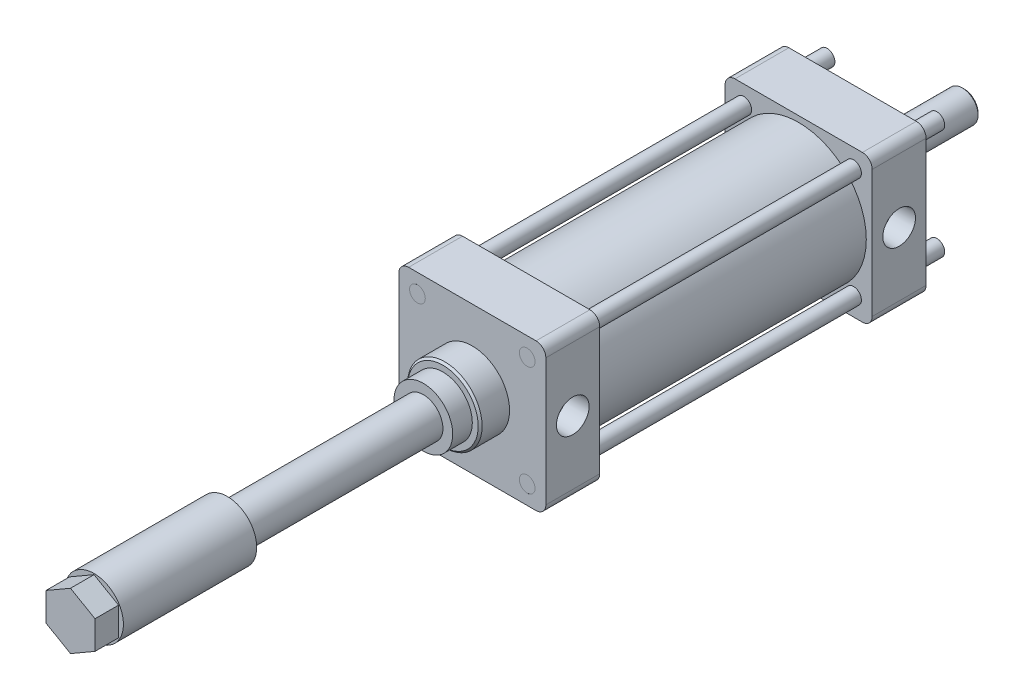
from build123d import *

# Parameters (mm, degrees)
SKETCH_1_R              = 4
EXTRUDE_1_DEPTH         = 27.5
SKETCH_2_R              = 19
EXTRUDE_2_DEPTH         = 15
SKETCH_3_R              = 10
EXTRUDE_3_DEPTH         = 10
SKETCH_4_R              = 8
EXTRUDE_4_DEPTH         = 32
CHAMFER_1_SIZE          = 1
SKETCH_5_R              = 34.5
EXTRUDE_5_DEPTH         = 139
SKETCH_6_R              = 4
EXTRUDE_6_DEPTH         = 27.5
EXTRUDE_START           = 15
SKETCH_7_R              = 19
EXTRUDE_7_DEPTH         = 15
CHAMFER_2_SIZE          = 1
SKETCH_8_R              = 15
EXTRUDE_8_DEPTH         = 10
EXTRUDE_START_2         = 100
SKETCH_9_R              = 10
EXTRUDE_9_DEPTH         = 100
SKETCH_10_R             = 15
EXTRUDE_10_DEPTH        = 68
EXTRUDE_11_DEPTH        = 12
EXTRUDE_12_DEPTH        = 15
EXTRUDE_12_DEPTH_BACK   = 194
SKETCH_12_R             = 4
EXTRUDE_12_2_DEPTH      = 15
EXTRUDE_12_2_DEPTH_BACK = 194
EXTRUDE_12_3_DEPTH      = 15
EXTRUDE_12_3_DEPTH_BACK = 194
EXTRUDE_12_4_DEPTH      = 15
EXTRUDE_12_4_DEPTH_BACK = 194
F_3_8_RC_1_AT_2_COUNT   = 2
F_3_8_RC_1_AT_2_PITCH   = 166.5


with BuildPart() as part:
    # Sketch 1 → Extrude 1 (new body)
    with BuildSketch(Plane.XY):
        with BuildLine():
            Line((32.5, 37.5), (-32.5, 37.5))
            ThreePointArc((-32.5, 37.5), (-36.035533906, 36.035533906), (-37.5, 32.5))
            Line((-37.5, 32.5), (-37.5, -32.5))
            ThreePointArc((-37.5, -32.5), (-36.035533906, -36.035533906), (-32.5, -37.5))
            Line((-32.5, -37.5), (32.5, -37.5))
            ThreePointArc((32.5, -37.5), (36.035533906, -36.035533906), (37.5, -32.5))
            Line((37.5, -32.5), (37.5, 32.5))
            ThreePointArc((37.5, 32.5), (36.035533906, 36.035533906), (32.5, 37.5))
        make_face()
        with Locations((28, -28)):
            Circle(SKETCH_1_R, mode=Mode.SUBTRACT)
        with Locations((-28, -28)):
            Circle(SKETCH_1_R, mode=Mode.SUBTRACT)
        with Locations((-28, 28)):
            Circle(SKETCH_1_R, mode=Mode.SUBTRACT)
        with Locations((28, 28)):
            Circle(SKETCH_1_R, mode=Mode.SUBTRACT)
    extrude(amount=EXTRUDE_1_DEPTH)

    # Sketch 2 → Extrude 2 (add)
    with BuildSketch(Plane(origin=(0, 0, 0), x_dir=(-1, 0, 0), z_dir=(0, 0, -1))):
        with Locations(Location((0, 0, 0), (0, 0, 180))):
            Circle(SKETCH_2_R)
    extrude(amount=EXTRUDE_2_DEPTH)

    # Sketch 3 → Extrude 3 (add)
    with BuildSketch(Plane(origin=(0, 0, -15), x_dir=(-1, 0, 0), z_dir=(0, 0, -1))):
        Circle(SKETCH_3_R)
    extrude(amount=EXTRUDE_3_DEPTH)

    # Sketch 4 → Extrude 4 (add)
    with BuildSketch(Plane(origin=(0, 0, -25), x_dir=(-1, 0, 0), z_dir=(0, 0, -1))):
        Circle(SKETCH_4_R)
    extrude(amount=EXTRUDE_4_DEPTH)

    # Chamfer 1
    chamfer_1_edges = [part.edges().sort_by_distance(p)[0] for p in [
        (-19, 0, -15),
        (10, 0, -25),
        (8, 0, -57),
    ]]
    chamfer(chamfer_1_edges, length=CHAMFER_1_SIZE)

    # Sketch 5 → Extrude 5 (add)
    with BuildSketch(Plane.XY.offset(27.5)):
        Circle(SKETCH_5_R)
    extrude(amount=EXTRUDE_5_DEPTH)

    # Sketch 6 → Extrude 6 (add)
    with BuildSketch(Plane.XY.offset(166.5)):
        with BuildLine():
            Line((-37.5, 32.5), (-37.5, -32.5))
            ThreePointArc((-37.5, -32.5), (-36.035533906, -36.035533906), (-32.5, -37.5))
            Line((-32.5, -37.5), (32.5, -37.5))
            ThreePointArc((32.5, -37.5), (36.035533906, -36.035533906), (37.5, -32.5))
            Line((37.5, -32.5), (37.5, 32.5))
            ThreePointArc((37.5, 32.5), (36.035533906, 36.035533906), (32.5, 37.5))
            Line((32.5, 37.5), (-32.5, 37.5))
            ThreePointArc((-32.5, 37.5), (-36.035533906, 36.035533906), (-37.5, 32.5))
        make_face()
        with Locations((-28, 28)):
            Circle(SKETCH_6_R, mode=Mode.SUBTRACT)
        with Locations((-28, -28)):
            Circle(SKETCH_6_R, mode=Mode.SUBTRACT)
        with Locations((28, -28)):
            Circle(SKETCH_6_R, mode=Mode.SUBTRACT)
        with Locations((28, 28)):
            Circle(SKETCH_6_R, mode=Mode.SUBTRACT)
    extrude(amount=EXTRUDE_6_DEPTH)

    # Sketch 7 → Extrude 7 (add)
    with BuildSketch(Plane.XY.offset(194).offset(EXTRUDE_START)):
        Circle(SKETCH_7_R)
    extrude(amount=-EXTRUDE_7_DEPTH)

    # Chamfer 2
    chamfer_2_edges = [part.edges().sort_by_distance(p)[0] for p in [
        (-19, 0, 209),
    ]]
    chamfer(chamfer_2_edges, length=CHAMFER_2_SIZE)

    # Sketch 8 → Extrude 8 (add)
    with BuildSketch(Plane.XY.offset(209)):
        Circle(SKETCH_8_R)
    extrude(amount=EXTRUDE_8_DEPTH)

    # Sketch 9 → Extrude 9 (add)
    with BuildSketch(Plane.XY.offset(219).offset(EXTRUDE_START_2)):
        with Locations(Location((0, 0, 0), (0, 0, 180))):
            Circle(SKETCH_9_R)
    extrude(amount=-EXTRUDE_9_DEPTH)

    # Sketch 10 → Extrude 10 (add)
    with BuildSketch(Plane.XY.offset(319)):
        Circle(SKETCH_10_R)
    extrude(amount=EXTRUDE_10_DEPTH)

    # Sketch 11 → Extrude 11 (add)
    with BuildSketch(Plane.XY.offset(387)):
        Polygon((0, -14.43375673), (12.5, -7.216878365), (12.5, 7.216878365), (0, 14.43375673), (-12.5, 7.216878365), (-12.5, -7.216878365), align=None)
    extrude(amount=EXTRUDE_11_DEPTH)

    # Sketch 14 → 3_8 Rc _1 (revolve, cut)
    with BuildSketch(Plane(origin=(37.5, 0, 13.75), x_dir=(0, 0, -1), z_dir=(0, 1, 0))):
        Polygon((0, 0), (0, 22.386153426), (7.15, 18.09), (7.15, 11.4), (7.97513052, 11.4), (8.331, 0), align=None)
    f_3_8_rc_1 = revolve(axis=Axis((43.85, 0, 13.75), (-1, 0, 0)), mode=Mode.SUBTRACT)

    # 3_8 Rc _1 at 2: 3_8 Rc _1 ×2
    with Locations(*[(0, 0, i * F_3_8_RC_1_AT_2_PITCH) for i in range(1, F_3_8_RC_1_AT_2_COUNT)]):
        add(f_3_8_rc_1, mode=Mode.SUBTRACT)


with BuildPart() as body_2:
    # Sketch 12 → Extrude 12 (new, two sides: drawn at the far end of the back side and taken through both)
    with BuildSketch(Plane(origin=(0, 0, 0), x_dir=(-1, 0, 0), z_dir=(0, 0, -1)).offset(-EXTRUDE_12_DEPTH_BACK)):
        with Locations((-28, 28)):
            Circle(SKETCH_12_R)
    extrude(amount=EXTRUDE_12_DEPTH + EXTRUDE_12_DEPTH_BACK)


with BuildPart() as body_3:
    # Sketch 12 → Extrude 12 2 (new, two sides: drawn at the far end of the back side and taken through both)
    with BuildSketch(Plane(origin=(0, 0, 0), x_dir=(-1, 0, 0), z_dir=(0, 0, -1)).offset(-EXTRUDE_12_2_DEPTH_BACK)):
        with Locations((28, 28)):
            Circle(SKETCH_12_R)
    extrude(amount=EXTRUDE_12_2_DEPTH + EXTRUDE_12_2_DEPTH_BACK)


with BuildPart() as body_4:
    # Sketch 12 → Extrude 12 3 (new, two sides: drawn at the far end of the back side and taken through both)
    with BuildSketch(Plane(origin=(0, 0, 0), x_dir=(-1, 0, 0), z_dir=(0, 0, -1)).offset(-EXTRUDE_12_3_DEPTH_BACK)):
        with Locations((28, -28)):
            Circle(SKETCH_12_R)
    extrude(amount=EXTRUDE_12_3_DEPTH + EXTRUDE_12_3_DEPTH_BACK)


with BuildPart() as body_5:
    # Sketch 12 → Extrude 12 4 (new, two sides: drawn at the far end of the back side and taken through both)
    with BuildSketch(Plane(origin=(0, 0, 0), x_dir=(-1, 0, 0), z_dir=(0, 0, -1)).offset(-EXTRUDE_12_4_DEPTH_BACK)):
        with Locations((-28, -28)):
            Circle(SKETCH_12_R)
    extrude(amount=EXTRUDE_12_4_DEPTH + EXTRUDE_12_4_DEPTH_BACK)


solid = Compound([part.part, body_2.part, body_3.part, body_4.part, body_5.part])
